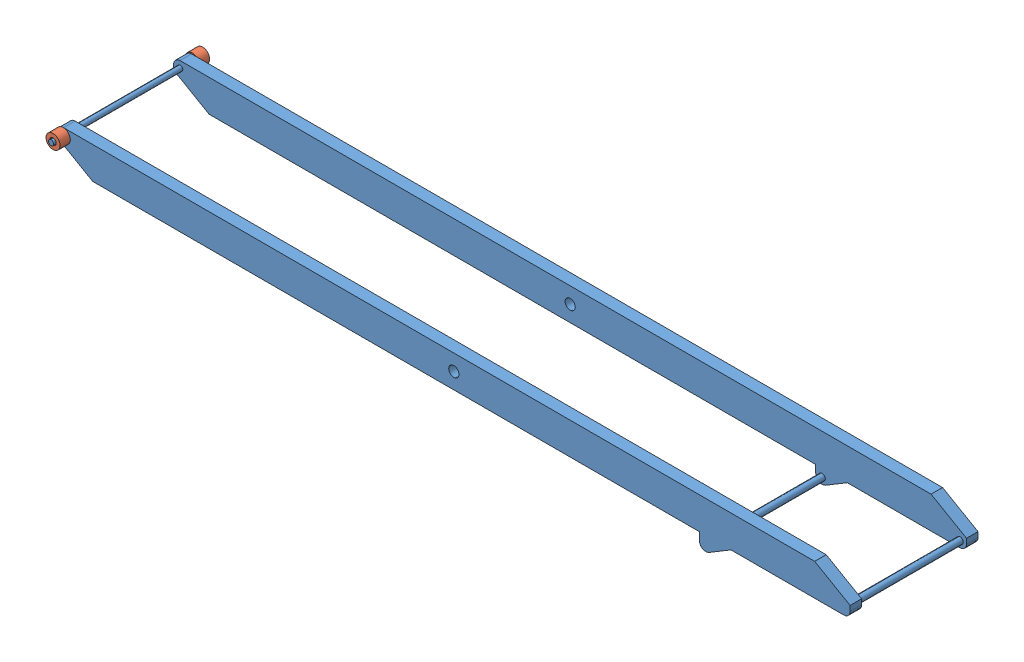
SolidWorks assembly Assemblage1.sldasm, configuration Défaut (file format 3400). Lengths in mm.
Overall size (6216.35 378.19 1200).
3 component instances, 2 part files, 4 mates.
Components (placement in the parent):
- ciseau 2-1: ciseau 2.SLDPRT [Défaut] at origin size (6200 360 1200)
- galet-1: galet.SLDPRT [Défaut] at (-6098.1555 150 505) size (110 110 80)
- galet-2: galet.SLDPRT [Défaut] at (-6098.1555 150 -585) x (-0.279865 -0.960039 0) z (0 0 1) size (110 110 80)
Mates (geometry in assembly coordinates):
- Coaxiale1: concentric aligned: cylinder of ?; cylinder of ?
- Distance1: distance = 5 mm anti-aligned: plane of ?; plane of ?
- Coaxiale2: concentric aligned: cylinder of ?; cylinder of ?
- Distance2: distance = 5 mm anti-aligned: plane of ?; plane of ?
